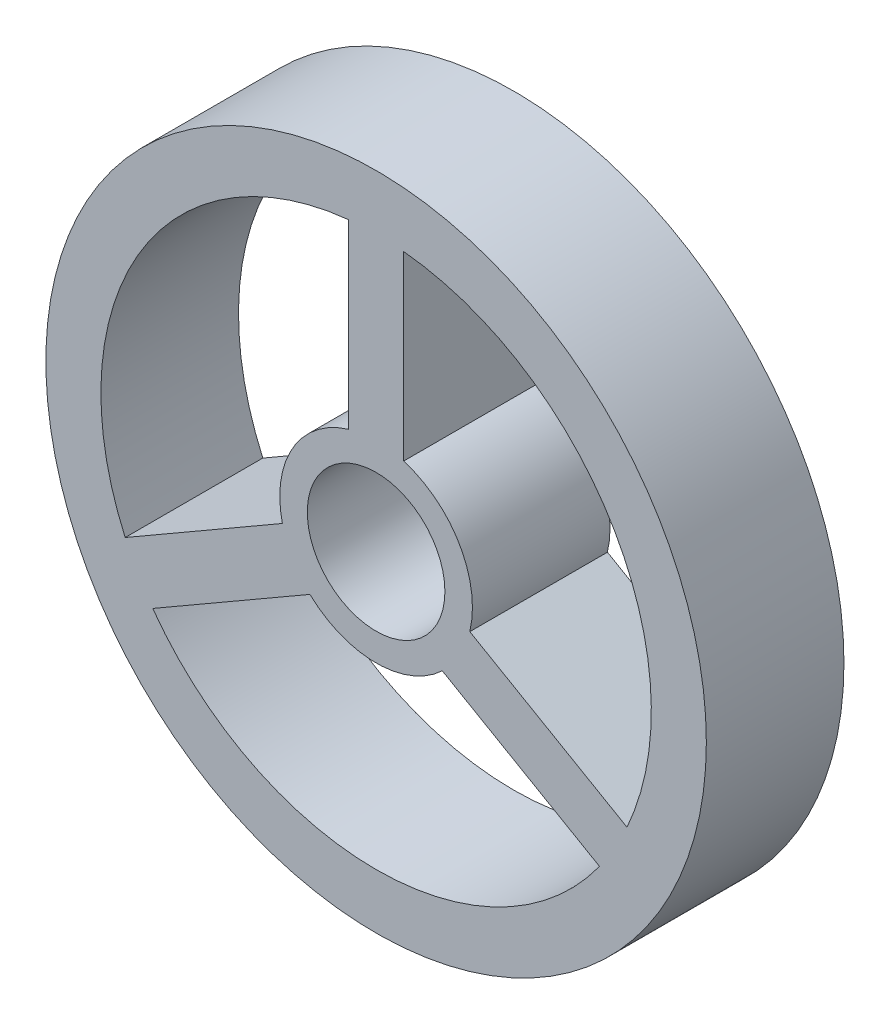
ISO-10303-21;
HEADER;
FILE_DESCRIPTION(('STEP AP214'),'2;1');
FILE_NAME('part.step','',(''),(''),'','','');
FILE_SCHEMA(('AUTOMOTIVE_DESIGN { 1 0 10303 214 1 1 1 1 }'));
ENDSEC;
DATA;
#1=APPLICATION_CONTEXT('core data for automotive mechanical design processes');
#2=APPLICATION_PROTOCOL_DEFINITION('international standard','automotive_design',2000,#1);
#3=PRODUCT_CONTEXT('',#1,'mechanical');
#4=PRODUCT('Part','Part','',(#3));
#5=PRODUCT_RELATED_PRODUCT_CATEGORY('part','',(#4));
#6=PRODUCT_DEFINITION_FORMATION('','',#4);
#7=PRODUCT_DEFINITION_CONTEXT('part definition',#1,'design');
#8=PRODUCT_DEFINITION('design','',#6,#7);
#9=PRODUCT_DEFINITION_SHAPE('','',#8);
#10=(LENGTH_UNIT() NAMED_UNIT(*) SI_UNIT(.MILLI.,.METRE.));
#11=(NAMED_UNIT(*) PLANE_ANGLE_UNIT() SI_UNIT($,.RADIAN.));
#12=(NAMED_UNIT(*) SI_UNIT($,.STERADIAN.) SOLID_ANGLE_UNIT());
#13=UNCERTAINTY_MEASURE_WITH_UNIT(LENGTH_MEASURE(1.E-05),#10,'distance_accuracy_value','');
#14=(GEOMETRIC_REPRESENTATION_CONTEXT(3) GLOBAL_UNCERTAINTY_ASSIGNED_CONTEXT((#13)) GLOBAL_UNIT_ASSIGNED_CONTEXT((#10,
#11,#12)) REPRESENTATION_CONTEXT('',''));
#15=CARTESIAN_POINT('',(0.,0.,0.));
#16=DIRECTION('',(0.,0.,1.));
#17=DIRECTION('',(1.,0.,0.));
#18=AXIS2_PLACEMENT_3D('',#15,#16,#17);
#19=CARTESIAN_POINT('',(0.,0.,5.));
#20=DIRECTION('',(0.,0.,1.));
#21=DIRECTION('',(1.,0.,0.));
#22=AXIS2_PLACEMENT_3D('',#19,#20,#21);
#23=PLANE('',#22);
#24=DIRECTION('',(0.866025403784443,0.499999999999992,0.));
#25=VECTOR('',#24,1.);
#26=CARTESIAN_POINT('',(-9.11684396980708,-4.10891178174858,5.));
#27=LINE('',#26,#25);
#28=CARTESIAN_POINT('',(-9.11684396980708,-4.10891178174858,5.));
#29=VERTEX_POINT('',#28);
#30=CARTESIAN_POINT('',(-3.40473750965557,-0.811025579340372,5.));
#31=VERTEX_POINT('',#30);
#32=EDGE_CURVE('E159',#29,#31,#27,.T.);
#33=ORIENTED_EDGE('',*,*,#32,.F.);
#34=CARTESIAN_POINT('',(0.,0.,5.));
#35=DIRECTION('',(0.,0.,1.));
#36=DIRECTION('',(1.,0.,0.));
#37=AXIS2_PLACEMENT_3D('',#34,#35,#36);
#38=CIRCLE('',#37,10.);
#39=CARTESIAN_POINT('',(-1.,9.9498743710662,5.));
#40=VERTEX_POINT('',#39);
#41=EDGE_CURVE('E157',#40,#29,#38,.T.);
#42=ORIENTED_EDGE('',*,*,#41,.F.);
#43=DIRECTION('',(0.,1.,0.));
#44=VECTOR('',#43,1.);
#45=CARTESIAN_POINT('',(-1.,9.9498743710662,5.));
#46=LINE('',#45,#44);
#47=CARTESIAN_POINT('',(-0.999999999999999,3.35410196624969,5.));
#48=VERTEX_POINT('',#47);
#49=EDGE_CURVE('E165',#48,#40,#46,.T.);
#50=ORIENTED_EDGE('',*,*,#49,.F.);
#51=CARTESIAN_POINT('',(0.,0.,5.));
#52=DIRECTION('',(0.,0.,-1.));
#53=DIRECTION('',(1.,0.,0.));
#54=AXIS2_PLACEMENT_3D('',#51,#52,#53);
#55=CIRCLE('',#54,3.5);
#56=EDGE_CURVE('E162',#31,#48,#55,.T.);
#57=ORIENTED_EDGE('',*,*,#56,.F.);
#58=EDGE_LOOP('',(#33,#42,#50,#57));
#59=FACE_BOUND('',#58,.T.);
#60=CARTESIAN_POINT('',(0.,0.,5.));
#61=DIRECTION('',(0.,0.,1.));
#62=DIRECTION('',(1.,0.,0.));
#63=AXIS2_PLACEMENT_3D('',#60,#61,#62);
#64=CIRCLE('',#63,2.5);
#65=CARTESIAN_POINT('',(2.5,0.,5.));
#66=VERTEX_POINT('',#65);
#67=EDGE_CURVE('E219',#66,#66,#64,.T.);
#68=ORIENTED_EDGE('',*,*,#67,.F.);
#69=EDGE_LOOP('',(#68));
#70=FACE_BOUND('',#69,.T.);
#71=CARTESIAN_POINT('',(0.,0.,5.));
#72=DIRECTION('',(0.,0.,1.));
#73=DIRECTION('',(1.,0.,0.));
#74=AXIS2_PLACEMENT_3D('',#71,#72,#73);
#75=CIRCLE('',#74,12.);
#76=CARTESIAN_POINT('',(12.,0.,5.));
#77=VERTEX_POINT('',#76);
#78=EDGE_CURVE('E11',#77,#77,#75,.T.);
#79=ORIENTED_EDGE('',*,*,#78,.T.);
#80=EDGE_LOOP('',(#79));
#81=FACE_BOUND('',#80,.T.);
#82=DIRECTION('',(0.,-1.,0.));
#83=VECTOR('',#82,1.);
#84=CARTESIAN_POINT('',(1.,9.9498743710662,5.));
#85=LINE('',#84,#83);
#86=CARTESIAN_POINT('',(1.,9.9498743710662,5.));
#87=VERTEX_POINT('',#86);
#88=CARTESIAN_POINT('',(1.,3.35410196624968,5.));
#89=VERTEX_POINT('',#88);
#90=EDGE_CURVE('E190',#87,#89,#85,.T.);
#91=ORIENTED_EDGE('',*,*,#90,.F.);
#92=CARTESIAN_POINT('',(0.,0.,5.));
#93=DIRECTION('',(0.,0.,1.));
#94=DIRECTION('',(1.,0.,0.));
#95=AXIS2_PLACEMENT_3D('',#92,#93,#94);
#96=CIRCLE('',#95,10.);
#97=CARTESIAN_POINT('',(9.11684396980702,-4.10891178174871,5.));
#98=VERTEX_POINT('',#97);
#99=EDGE_CURVE('E188',#98,#87,#96,.T.);
#100=ORIENTED_EDGE('',*,*,#99,.F.);
#101=DIRECTION('',(0.866025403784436,-0.500000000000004,0.));
#102=VECTOR('',#101,1.);
#103=CARTESIAN_POINT('',(9.11684396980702,-4.10891178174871,5.));
#104=LINE('',#103,#102);
#105=CARTESIAN_POINT('',(3.40473750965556,-0.811025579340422,5.));
#106=VERTEX_POINT('',#105);
#107=EDGE_CURVE('E196',#106,#98,#104,.T.);
#108=ORIENTED_EDGE('',*,*,#107,.F.);
#109=CARTESIAN_POINT('',(0.,0.,5.));
#110=DIRECTION('',(0.,0.,-1.));
#111=DIRECTION('',(1.,0.,0.));
#112=AXIS2_PLACEMENT_3D('',#109,#110,#111);
#113=CIRCLE('',#112,3.5);
#114=EDGE_CURVE('E193',#89,#106,#113,.T.);
#115=ORIENTED_EDGE('',*,*,#114,.F.);
#116=EDGE_LOOP('',(#91,#100,#108,#115));
#117=FACE_BOUND('',#116,.T.);
#118=DIRECTION('',(-0.866025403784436,0.500000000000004,0.));
#119=VECTOR('',#118,1.);
#120=CARTESIAN_POINT('',(8.11684396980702,-5.84096258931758,5.));
#121=LINE('',#120,#119);
#122=CARTESIAN_POINT('',(8.11684396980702,-5.84096258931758,5.));
#123=VERTEX_POINT('',#122);
#124=CARTESIAN_POINT('',(2.40473750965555,-2.54307638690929,5.));
#125=VERTEX_POINT('',#124);
#126=EDGE_CURVE('E129',#123,#125,#121,.T.);
#127=ORIENTED_EDGE('',*,*,#126,.F.);
#128=CARTESIAN_POINT('',(0.,0.,5.));
#129=DIRECTION('',(0.,0.,1.));
#130=DIRECTION('',(1.,0.,0.));
#131=AXIS2_PLACEMENT_3D('',#128,#129,#130);
#132=CIRCLE('',#131,10.);
#133=CARTESIAN_POINT('',(-8.1168439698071,-5.84096258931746,5.));
#134=VERTEX_POINT('',#133);
#135=EDGE_CURVE('E121',#134,#123,#132,.T.);
#136=ORIENTED_EDGE('',*,*,#135,.F.);
#137=DIRECTION('',(-0.866025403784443,-0.499999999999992,0.));
#138=VECTOR('',#137,1.);
#139=CARTESIAN_POINT('',(-8.1168439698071,-5.84096258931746,5.));
#140=LINE('',#139,#138);
#141=CARTESIAN_POINT('',(-2.40473750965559,-2.54307638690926,5.));
#142=VERTEX_POINT('',#141);
#143=EDGE_CURVE('E143',#142,#134,#140,.T.);
#144=ORIENTED_EDGE('',*,*,#143,.F.);
#145=CARTESIAN_POINT('',(0.,0.,5.));
#146=DIRECTION('',(0.,0.,-1.));
#147=DIRECTION('',(1.,0.,0.));
#148=AXIS2_PLACEMENT_3D('',#145,#146,#147);
#149=CIRCLE('',#148,3.5);
#150=EDGE_CURVE('E141',#125,#142,#149,.T.);
#151=ORIENTED_EDGE('',*,*,#150,.F.);
#152=EDGE_LOOP('',(#127,#136,#144,#151));
#153=FACE_BOUND('',#152,.T.);
#154=ADVANCED_FACE('F32',(#59,#70,#81,#117,#153),#23,.T.);
#155=CARTESIAN_POINT('',(0.,0.,0.));
#156=DIRECTION('',(0.,0.,1.));
#157=DIRECTION('',(1.,0.,0.));
#158=AXIS2_PLACEMENT_3D('',#155,#156,#157);
#159=PLANE('',#158);
#160=CARTESIAN_POINT('',(0.,0.,0.));
#161=DIRECTION('',(0.,0.,1.));
#162=DIRECTION('',(1.,0.,0.));
#163=AXIS2_PLACEMENT_3D('',#160,#161,#162);
#164=CIRCLE('',#163,10.);
#165=CARTESIAN_POINT('',(-1.,9.9498743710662,0.));
#166=VERTEX_POINT('',#165);
#167=CARTESIAN_POINT('',(-9.11684396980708,-4.10891178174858,0.));
#168=VERTEX_POINT('',#167);
#169=EDGE_CURVE('E137',#166,#168,#164,.T.);
#170=ORIENTED_EDGE('',*,*,#169,.T.);
#171=DIRECTION('',(0.866025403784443,0.499999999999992,0.));
#172=VECTOR('',#171,1.);
#173=CARTESIAN_POINT('',(-9.11684396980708,-4.10891178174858,0.));
#174=LINE('',#173,#172);
#175=CARTESIAN_POINT('',(-3.40473750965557,-0.811025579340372,0.));
#176=VERTEX_POINT('',#175);
#177=EDGE_CURVE('E170',#168,#176,#174,.T.);
#178=ORIENTED_EDGE('',*,*,#177,.T.);
#179=CARTESIAN_POINT('',(0.,0.,0.));
#180=DIRECTION('',(0.,0.,-1.));
#181=DIRECTION('',(1.,0.,0.));
#182=AXIS2_PLACEMENT_3D('',#179,#180,#181);
#183=CIRCLE('',#182,3.5);
#184=CARTESIAN_POINT('',(-0.999999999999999,3.35410196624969,0.));
#185=VERTEX_POINT('',#184);
#186=EDGE_CURVE('E173',#176,#185,#183,.T.);
#187=ORIENTED_EDGE('',*,*,#186,.T.);
#188=DIRECTION('',(0.,1.,0.));
#189=VECTOR('',#188,1.);
#190=CARTESIAN_POINT('',(-1.,9.9498743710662,0.));
#191=LINE('',#190,#189);
#192=EDGE_CURVE('E160',#185,#166,#191,.T.);
#193=ORIENTED_EDGE('',*,*,#192,.T.);
#194=EDGE_LOOP('',(#170,#178,#187,#193));
#195=FACE_BOUND('',#194,.T.);
#196=CARTESIAN_POINT('',(0.,0.,0.));
#197=DIRECTION('',(0.,0.,1.));
#198=DIRECTION('',(1.,0.,0.));
#199=AXIS2_PLACEMENT_3D('',#196,#197,#198);
#200=CIRCLE('',#199,2.5);
#201=CARTESIAN_POINT('',(2.5,0.,0.));
#202=VERTEX_POINT('',#201);
#203=EDGE_CURVE('E218',#202,#202,#200,.T.);
#204=ORIENTED_EDGE('',*,*,#203,.T.);
#205=EDGE_LOOP('',(#204));
#206=FACE_BOUND('',#205,.T.);
#207=CARTESIAN_POINT('',(0.,0.,0.));
#208=DIRECTION('',(0.,0.,1.));
#209=DIRECTION('',(1.,0.,0.));
#210=AXIS2_PLACEMENT_3D('',#207,#208,#209);
#211=CIRCLE('',#210,12.);
#212=CARTESIAN_POINT('',(12.,0.,0.));
#213=VERTEX_POINT('',#212);
#214=EDGE_CURVE('E36',#213,#213,#211,.T.);
#215=ORIENTED_EDGE('',*,*,#214,.F.);
#216=EDGE_LOOP('',(#215));
#217=FACE_BOUND('',#216,.T.);
#218=CARTESIAN_POINT('',(0.,0.,0.));
#219=DIRECTION('',(0.,0.,1.));
#220=DIRECTION('',(1.,0.,0.));
#221=AXIS2_PLACEMENT_3D('',#218,#219,#220);
#222=CIRCLE('',#221,10.);
#223=CARTESIAN_POINT('',(9.11684396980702,-4.10891178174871,0.));
#224=VERTEX_POINT('',#223);
#225=CARTESIAN_POINT('',(1.,9.9498743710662,0.));
#226=VERTEX_POINT('',#225);
#227=EDGE_CURVE('E187',#224,#226,#222,.T.);
#228=ORIENTED_EDGE('',*,*,#227,.T.);
#229=DIRECTION('',(0.,-1.,0.));
#230=VECTOR('',#229,1.);
#231=CARTESIAN_POINT('',(1.,9.9498743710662,0.));
#232=LINE('',#231,#230);
#233=CARTESIAN_POINT('',(1.,3.35410196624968,0.));
#234=VERTEX_POINT('',#233);
#235=EDGE_CURVE('E201',#226,#234,#232,.T.);
#236=ORIENTED_EDGE('',*,*,#235,.T.);
#237=CARTESIAN_POINT('',(0.,0.,0.));
#238=DIRECTION('',(0.,0.,-1.));
#239=DIRECTION('',(1.,0.,0.));
#240=AXIS2_PLACEMENT_3D('',#237,#238,#239);
#241=CIRCLE('',#240,3.5);
#242=CARTESIAN_POINT('',(3.40473750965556,-0.811025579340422,0.));
#243=VERTEX_POINT('',#242);
#244=EDGE_CURVE('E204',#234,#243,#241,.T.);
#245=ORIENTED_EDGE('',*,*,#244,.T.);
#246=DIRECTION('',(0.866025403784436,-0.500000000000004,0.));
#247=VECTOR('',#246,1.);
#248=CARTESIAN_POINT('',(9.11684396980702,-4.10891178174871,0.));
#249=LINE('',#248,#247);
#250=EDGE_CURVE('E191',#243,#224,#249,.T.);
#251=ORIENTED_EDGE('',*,*,#250,.T.);
#252=EDGE_LOOP('',(#228,#236,#245,#251));
#253=FACE_BOUND('',#252,.T.);
#254=CARTESIAN_POINT('',(0.,0.,0.));
#255=DIRECTION('',(0.,0.,1.));
#256=DIRECTION('',(1.,0.,0.));
#257=AXIS2_PLACEMENT_3D('',#254,#255,#256);
#258=CIRCLE('',#257,10.);
#259=CARTESIAN_POINT('',(-8.1168439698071,-5.84096258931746,0.));
#260=VERTEX_POINT('',#259);
#261=CARTESIAN_POINT('',(8.11684396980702,-5.84096258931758,0.));
#262=VERTEX_POINT('',#261);
#263=EDGE_CURVE('E55',#260,#262,#258,.T.);
#264=ORIENTED_EDGE('',*,*,#263,.T.);
#265=DIRECTION('',(-0.866025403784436,0.500000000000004,0.));
#266=VECTOR('',#265,1.);
#267=CARTESIAN_POINT('',(8.11684396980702,-5.84096258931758,0.));
#268=LINE('',#267,#266);
#269=CARTESIAN_POINT('',(2.40473750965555,-2.54307638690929,0.));
#270=VERTEX_POINT('',#269);
#271=EDGE_CURVE('E136',#262,#270,#268,.T.);
#272=ORIENTED_EDGE('',*,*,#271,.T.);
#273=CARTESIAN_POINT('',(0.,0.,0.));
#274=DIRECTION('',(0.,0.,-1.));
#275=DIRECTION('',(1.,0.,0.));
#276=AXIS2_PLACEMENT_3D('',#273,#274,#275);
#277=CIRCLE('',#276,3.5);
#278=CARTESIAN_POINT('',(-2.40473750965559,-2.54307638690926,0.));
#279=VERTEX_POINT('',#278);
#280=EDGE_CURVE('E149',#270,#279,#277,.T.);
#281=ORIENTED_EDGE('',*,*,#280,.T.);
#282=DIRECTION('',(-0.866025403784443,-0.499999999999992,0.));
#283=VECTOR('',#282,1.);
#284=CARTESIAN_POINT('',(-8.1168439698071,-5.84096258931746,0.));
#285=LINE('',#284,#283);
#286=EDGE_CURVE('E130',#279,#260,#285,.T.);
#287=ORIENTED_EDGE('',*,*,#286,.T.);
#288=EDGE_LOOP('',(#264,#272,#281,#287));
#289=FACE_BOUND('',#288,.T.);
#290=ADVANCED_FACE('F225',(#195,#206,#217,#253,#289),#159,.F.);
#291=CARTESIAN_POINT('',(0.,0.,5.));
#292=DIRECTION('',(0.,0.,-1.));
#293=DIRECTION('',(-1.,0.,0.));
#294=AXIS2_PLACEMENT_3D('',#291,#292,#293);
#295=CYLINDRICAL_SURFACE('',#294,12.);
#296=ORIENTED_EDGE('',*,*,#78,.F.);
#297=EDGE_LOOP('',(#296));
#298=FACE_BOUND('',#297,.T.);
#299=ORIENTED_EDGE('',*,*,#214,.T.);
#300=EDGE_LOOP('',(#299));
#301=FACE_BOUND('',#300,.T.);
#302=ADVANCED_FACE('F34',(#298,#301),#295,.T.);
#303=CARTESIAN_POINT('',(0.,0.,5.));
#304=DIRECTION('',(0.,0.,-1.));
#305=DIRECTION('',(-1.,0.,0.));
#306=AXIS2_PLACEMENT_3D('',#303,#304,#305);
#307=CYLINDRICAL_SURFACE('',#306,2.5);
#308=ORIENTED_EDGE('',*,*,#67,.T.);
#309=EDGE_LOOP('',(#308));
#310=FACE_BOUND('',#309,.T.);
#311=ORIENTED_EDGE('',*,*,#203,.F.);
#312=EDGE_LOOP('',(#311));
#313=FACE_BOUND('',#312,.T.);
#314=ADVANCED_FACE('F228',(#310,#313),#307,.F.);
#315=CARTESIAN_POINT('',(0.,0.,5.));
#316=DIRECTION('',(0.,0.,-1.));
#317=DIRECTION('',(-1.,0.,0.));
#318=AXIS2_PLACEMENT_3D('',#315,#316,#317);
#319=CYLINDRICAL_SURFACE('',#318,10.);
#320=ORIENTED_EDGE('',*,*,#227,.F.);
#321=DIRECTION('',(0.,0.,-1.));
#322=VECTOR('',#321,1.);
#323=CARTESIAN_POINT('',(9.11684396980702,-4.10891178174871,5.));
#324=LINE('',#323,#322);
#325=EDGE_CURVE('E198',#98,#224,#324,.T.);
#326=ORIENTED_EDGE('',*,*,#325,.F.);
#327=ORIENTED_EDGE('',*,*,#99,.T.);
#328=DIRECTION('',(0.,0.,-1.));
#329=VECTOR('',#328,1.);
#330=CARTESIAN_POINT('',(1.,9.9498743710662,5.));
#331=LINE('',#330,#329);
#332=EDGE_CURVE('E215',#87,#226,#331,.T.);
#333=ORIENTED_EDGE('',*,*,#332,.T.);
#334=EDGE_LOOP('',(#320,#326,#327,#333));
#335=FACE_BOUND('',#334,.T.);
#336=ADVANCED_FACE('F230',(#335),#319,.F.);
#337=CARTESIAN_POINT('',(1.,9.9498743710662,5.));
#338=DIRECTION('',(1.,0.,0.));
#339=DIRECTION('',(0.,1.,0.));
#340=AXIS2_PLACEMENT_3D('',#337,#338,#339);
#341=PLANE('',#340);
#342=ORIENTED_EDGE('',*,*,#235,.F.);
#343=ORIENTED_EDGE('',*,*,#332,.F.);
#344=ORIENTED_EDGE('',*,*,#90,.T.);
#345=DIRECTION('',(0.,0.,-1.));
#346=VECTOR('',#345,1.);
#347=CARTESIAN_POINT('',(1.,3.35410196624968,5.));
#348=LINE('',#347,#346);
#349=EDGE_CURVE('E213',#89,#234,#348,.T.);
#350=ORIENTED_EDGE('',*,*,#349,.T.);
#351=EDGE_LOOP('',(#342,#343,#344,#350));
#352=FACE_BOUND('',#351,.T.);
#353=ADVANCED_FACE('F237',(#352),#341,.T.);
#354=CARTESIAN_POINT('',(0.,0.,5.));
#355=DIRECTION('',(0.,0.,-1.));
#356=DIRECTION('',(-1.,0.,0.));
#357=AXIS2_PLACEMENT_3D('',#354,#355,#356);
#358=CYLINDRICAL_SURFACE('',#357,3.5);
#359=ORIENTED_EDGE('',*,*,#244,.F.);
#360=ORIENTED_EDGE('',*,*,#349,.F.);
#361=ORIENTED_EDGE('',*,*,#114,.T.);
#362=DIRECTION('',(0.,0.,-1.));
#363=VECTOR('',#362,1.);
#364=CARTESIAN_POINT('',(3.40473750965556,-0.811025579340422,5.));
#365=LINE('',#364,#363);
#366=EDGE_CURVE('E211',#106,#243,#365,.T.);
#367=ORIENTED_EDGE('',*,*,#366,.T.);
#368=EDGE_LOOP('',(#359,#360,#361,#367));
#369=FACE_BOUND('',#368,.T.);
#370=ADVANCED_FACE('F265',(#369),#358,.T.);
#371=CARTESIAN_POINT('',(9.11684396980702,-4.10891178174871,5.));
#372=DIRECTION('',(0.500000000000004,0.866025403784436,0.));
#373=DIRECTION('',(-0.866025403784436,0.500000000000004,0.));
#374=AXIS2_PLACEMENT_3D('',#371,#372,#373);
#375=PLANE('',#374);
#376=ORIENTED_EDGE('',*,*,#250,.F.);
#377=ORIENTED_EDGE('',*,*,#366,.F.);
#378=ORIENTED_EDGE('',*,*,#107,.T.);
#379=ORIENTED_EDGE('',*,*,#325,.T.);
#380=EDGE_LOOP('',(#376,#377,#378,#379));
#381=FACE_BOUND('',#380,.T.);
#382=ADVANCED_FACE('F271',(#381),#375,.T.);
#383=CARTESIAN_POINT('',(0.,0.,5.));
#384=DIRECTION('',(0.,0.,-1.));
#385=DIRECTION('',(-1.,0.,0.));
#386=AXIS2_PLACEMENT_3D('',#383,#384,#385);
#387=CYLINDRICAL_SURFACE('',#386,10.);
#388=ORIENTED_EDGE('',*,*,#169,.F.);
#389=DIRECTION('',(0.,0.,-1.));
#390=VECTOR('',#389,1.);
#391=CARTESIAN_POINT('',(-1.,9.9498743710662,5.));
#392=LINE('',#391,#390);
#393=EDGE_CURVE('E167',#40,#166,#392,.T.);
#394=ORIENTED_EDGE('',*,*,#393,.F.);
#395=ORIENTED_EDGE('',*,*,#41,.T.);
#396=DIRECTION('',(0.,0.,-1.));
#397=VECTOR('',#396,1.);
#398=CARTESIAN_POINT('',(-9.11684396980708,-4.10891178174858,5.));
#399=LINE('',#398,#397);
#400=EDGE_CURVE('E184',#29,#168,#399,.T.);
#401=ORIENTED_EDGE('',*,*,#400,.T.);
#402=EDGE_LOOP('',(#388,#394,#395,#401));
#403=FACE_BOUND('',#402,.T.);
#404=ADVANCED_FACE('F273',(#403),#387,.F.);
#405=CARTESIAN_POINT('',(-9.11684396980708,-4.10891178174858,5.));
#406=DIRECTION('',(-0.499999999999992,0.866025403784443,0.));
#407=DIRECTION('',(-0.866025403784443,-0.499999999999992,0.));
#408=AXIS2_PLACEMENT_3D('',#405,#406,#407);
#409=PLANE('',#408);
#410=ORIENTED_EDGE('',*,*,#177,.F.);
#411=ORIENTED_EDGE('',*,*,#400,.F.);
#412=ORIENTED_EDGE('',*,*,#32,.T.);
#413=DIRECTION('',(0.,0.,-1.));
#414=VECTOR('',#413,1.);
#415=CARTESIAN_POINT('',(-3.40473750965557,-0.811025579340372,5.));
#416=LINE('',#415,#414);
#417=EDGE_CURVE('E182',#31,#176,#416,.T.);
#418=ORIENTED_EDGE('',*,*,#417,.T.);
#419=EDGE_LOOP('',(#410,#411,#412,#418));
#420=FACE_BOUND('',#419,.T.);
#421=ADVANCED_FACE('F279',(#420),#409,.T.);
#422=CARTESIAN_POINT('',(0.,0.,5.));
#423=DIRECTION('',(0.,0.,-1.));
#424=DIRECTION('',(-1.,0.,0.));
#425=AXIS2_PLACEMENT_3D('',#422,#423,#424);
#426=CYLINDRICAL_SURFACE('',#425,3.5);
#427=ORIENTED_EDGE('',*,*,#186,.F.);
#428=ORIENTED_EDGE('',*,*,#417,.F.);
#429=ORIENTED_EDGE('',*,*,#56,.T.);
#430=DIRECTION('',(0.,0.,-1.));
#431=VECTOR('',#430,1.);
#432=CARTESIAN_POINT('',(-0.999999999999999,3.35410196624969,5.));
#433=LINE('',#432,#431);
#434=EDGE_CURVE('E180',#48,#185,#433,.T.);
#435=ORIENTED_EDGE('',*,*,#434,.T.);
#436=EDGE_LOOP('',(#427,#428,#429,#435));
#437=FACE_BOUND('',#436,.T.);
#438=ADVANCED_FACE('F313',(#437),#426,.T.);
#439=CARTESIAN_POINT('',(-1.,9.9498743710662,5.));
#440=DIRECTION('',(-1.,0.,0.));
#441=DIRECTION('',(0.,-1.,0.));
#442=AXIS2_PLACEMENT_3D('',#439,#440,#441);
#443=PLANE('',#442);
#444=ORIENTED_EDGE('',*,*,#192,.F.);
#445=ORIENTED_EDGE('',*,*,#434,.F.);
#446=ORIENTED_EDGE('',*,*,#49,.T.);
#447=ORIENTED_EDGE('',*,*,#393,.T.);
#448=EDGE_LOOP('',(#444,#445,#446,#447));
#449=FACE_BOUND('',#448,.T.);
#450=ADVANCED_FACE('F322',(#449),#443,.T.);
#451=CARTESIAN_POINT('',(0.,0.,5.));
#452=DIRECTION('',(0.,0.,-1.));
#453=DIRECTION('',(-1.,0.,0.));
#454=AXIS2_PLACEMENT_3D('',#451,#452,#453);
#455=CYLINDRICAL_SURFACE('',#454,10.);
#456=ORIENTED_EDGE('',*,*,#263,.F.);
#457=DIRECTION('',(0.,0.,-1.));
#458=VECTOR('',#457,1.);
#459=CARTESIAN_POINT('',(-8.1168439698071,-5.84096258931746,5.));
#460=LINE('',#459,#458);
#461=EDGE_CURVE('E125',#134,#260,#460,.T.);
#462=ORIENTED_EDGE('',*,*,#461,.F.);
#463=ORIENTED_EDGE('',*,*,#135,.T.);
#464=DIRECTION('',(0.,0.,-1.));
#465=VECTOR('',#464,1.);
#466=CARTESIAN_POINT('',(8.11684396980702,-5.84096258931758,5.));
#467=LINE('',#466,#465);
#468=EDGE_CURVE('E124',#123,#262,#467,.T.);
#469=ORIENTED_EDGE('',*,*,#468,.T.);
#470=EDGE_LOOP('',(#456,#462,#463,#469));
#471=FACE_BOUND('',#470,.T.);
#472=ADVANCED_FACE('F123',(#471),#455,.F.);
#473=CARTESIAN_POINT('',(8.11684396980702,-5.84096258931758,5.));
#474=DIRECTION('',(-0.500000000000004,-0.866025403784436,0.));
#475=DIRECTION('',(0.866025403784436,-0.500000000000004,0.));
#476=AXIS2_PLACEMENT_3D('',#473,#474,#475);
#477=PLANE('',#476);
#478=ORIENTED_EDGE('',*,*,#271,.F.);
#479=ORIENTED_EDGE('',*,*,#468,.F.);
#480=ORIENTED_EDGE('',*,*,#126,.T.);
#481=DIRECTION('',(0.,0.,-1.));
#482=VECTOR('',#481,1.);
#483=CARTESIAN_POINT('',(2.40473750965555,-2.54307638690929,5.));
#484=LINE('',#483,#482);
#485=EDGE_CURVE('E138',#125,#270,#484,.T.);
#486=ORIENTED_EDGE('',*,*,#485,.T.);
#487=EDGE_LOOP('',(#478,#479,#480,#486));
#488=FACE_BOUND('',#487,.T.);
#489=ADVANCED_FACE('F133',(#488),#477,.T.);
#490=CARTESIAN_POINT('',(0.,0.,5.));
#491=DIRECTION('',(0.,0.,-1.));
#492=DIRECTION('',(-1.,0.,0.));
#493=AXIS2_PLACEMENT_3D('',#490,#491,#492);
#494=CYLINDRICAL_SURFACE('',#493,3.5);
#495=ORIENTED_EDGE('',*,*,#280,.F.);
#496=ORIENTED_EDGE('',*,*,#485,.F.);
#497=ORIENTED_EDGE('',*,*,#150,.T.);
#498=DIRECTION('',(0.,0.,-1.));
#499=VECTOR('',#498,1.);
#500=CARTESIAN_POINT('',(-2.40473750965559,-2.54307638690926,5.));
#501=LINE('',#500,#499);
#502=EDGE_CURVE('E47',#142,#279,#501,.T.);
#503=ORIENTED_EDGE('',*,*,#502,.T.);
#504=EDGE_LOOP('',(#495,#496,#497,#503));
#505=FACE_BOUND('',#504,.T.);
#506=ADVANCED_FACE('F349',(#505),#494,.T.);
#507=CARTESIAN_POINT('',(-8.1168439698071,-5.84096258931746,5.));
#508=DIRECTION('',(0.499999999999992,-0.866025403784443,0.));
#509=DIRECTION('',(0.866025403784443,0.499999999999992,0.));
#510=AXIS2_PLACEMENT_3D('',#507,#508,#509);
#511=PLANE('',#510);
#512=ORIENTED_EDGE('',*,*,#286,.F.);
#513=ORIENTED_EDGE('',*,*,#502,.F.);
#514=ORIENTED_EDGE('',*,*,#143,.T.);
#515=ORIENTED_EDGE('',*,*,#461,.T.);
#516=EDGE_LOOP('',(#512,#513,#514,#515));
#517=FACE_BOUND('',#516,.T.);
#518=ADVANCED_FACE('F358',(#517),#511,.T.);
#519=CLOSED_SHELL('',(#154,#290,#302,#314,#336,#353,#370,#382,#404,#421,#438,#450,#472,#489,
#506,#518));
#520=MANIFOLD_SOLID_BREP('B2',#519);
#521=ADVANCED_BREP_SHAPE_REPRESENTATION('',(#18,#520),#14);
#522=SHAPE_DEFINITION_REPRESENTATION(#9,#521);
ENDSEC;
END-ISO-10303-21;
